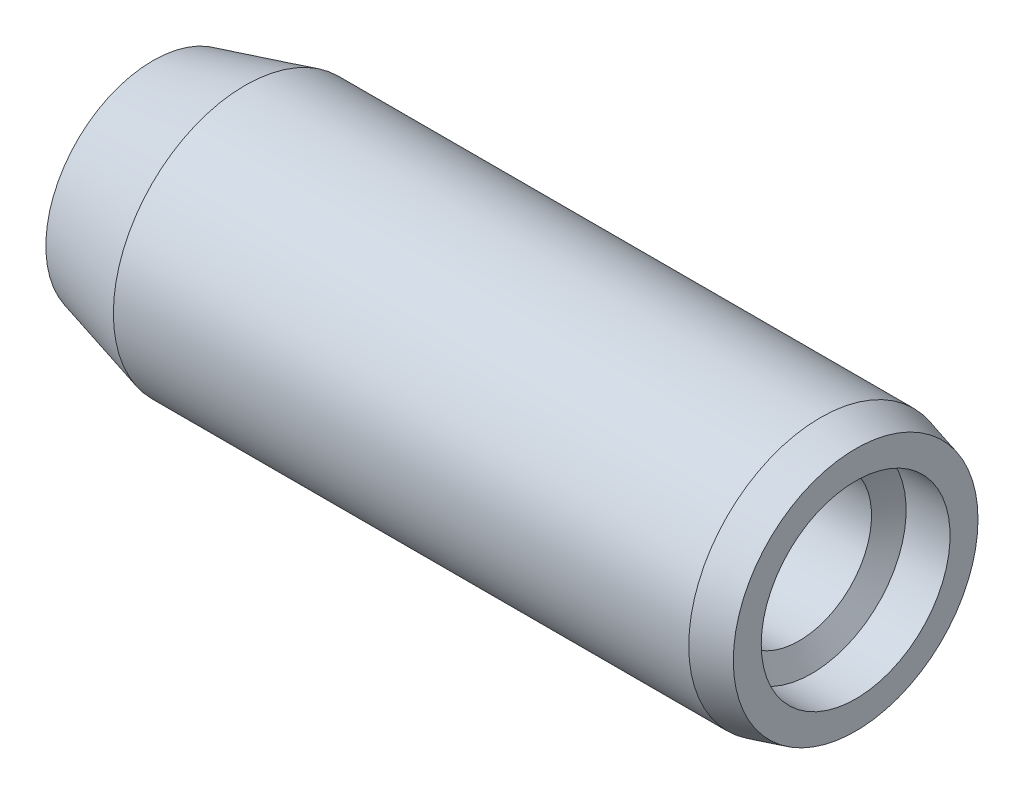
from build123d import *


with BuildPart() as part:
    # Sketch1 → Base-Revolve (revolve)
    with BuildSketch(Plane.XY, mode=Mode.PRIVATE) as base_revolve_sk:
        with BuildLine():
            Line((0.590443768, 2.595515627), (2.1, 3))
            Line((2.1, 3), (15.2, 3))
            Line((15.2, 3), (16, 2.785640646))
            Line((16, 2.785640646), (16, 0))
            Line((16, 0), (0, 0))
            ThreePointArc((0, 0), (0.149472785, 1.33091371), (0.590443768, 2.595515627))
        make_face()
    revolve(base_revolve_sk.sketch.rotate(Axis((-3.862476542, 0, 0), (1, 0, 0)), 90), axis=Axis((-3.862476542, 0, 0), (1, 0, 0)))

    # Sketch2 → Base-Revolve2 (revolve)
    with BuildSketch(Plane.XY):
        Polygon((0, 0), (0, 2.437306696), (2.1, 3), (15.2, 3), (16, 2.785640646), (16, 0), align=None)
    revolve(axis=Axis((0, 0, 0), (-1, 0, 0)))

    # Sketch3 → TypeA (revolve, cut)
    with BuildSketch(Plane.XY, mode=Mode.PRIVATE) as typea_sk:
        Polygon((16, 2.15), (16.2, 2.15), (16.2, 0), (16, 0), (5.047372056, 0), (6, 1.65), (14.711324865, 1.65), (15, 2.15), align=None)
    revolve(typea_sk.sketch.rotate(Axis((16, 0, 0), (1, 0, 0)), 90), axis=Axis((16, 0, 0), (1, 0, 0)), mode=Mode.SUBTRACT)


solid = part.part
